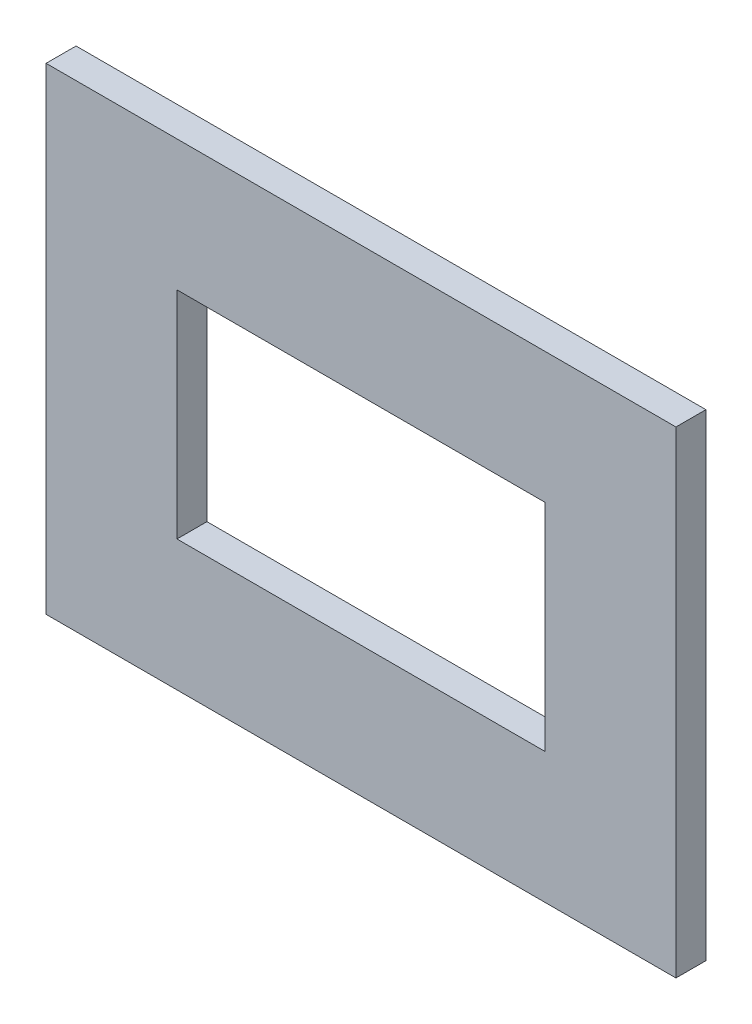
ISO-10303-21;
HEADER;
FILE_DESCRIPTION(('STEP AP214'),'2;1');
FILE_NAME('part.step','',(''),(''),'','','');
FILE_SCHEMA(('AUTOMOTIVE_DESIGN { 1 0 10303 214 1 1 1 1 }'));
ENDSEC;
DATA;
#1=APPLICATION_CONTEXT('core data for automotive mechanical design processes');
#2=APPLICATION_PROTOCOL_DEFINITION('international standard','automotive_design',2000,#1);
#3=PRODUCT_CONTEXT('',#1,'mechanical');
#4=PRODUCT('Part','Part','',(#3));
#5=PRODUCT_RELATED_PRODUCT_CATEGORY('part','',(#4));
#6=PRODUCT_DEFINITION_FORMATION('','',#4);
#7=PRODUCT_DEFINITION_CONTEXT('part definition',#1,'design');
#8=PRODUCT_DEFINITION('design','',#6,#7);
#9=PRODUCT_DEFINITION_SHAPE('','',#8);
#10=(LENGTH_UNIT() NAMED_UNIT(*) SI_UNIT(.MILLI.,.METRE.));
#11=(NAMED_UNIT(*) PLANE_ANGLE_UNIT() SI_UNIT($,.RADIAN.));
#12=(NAMED_UNIT(*) SI_UNIT($,.STERADIAN.) SOLID_ANGLE_UNIT());
#13=UNCERTAINTY_MEASURE_WITH_UNIT(LENGTH_MEASURE(1.E-05),#10,'distance_accuracy_value','');
#14=(GEOMETRIC_REPRESENTATION_CONTEXT(3) GLOBAL_UNCERTAINTY_ASSIGNED_CONTEXT((#13)) GLOBAL_UNIT_ASSIGNED_CONTEXT((#10,
#11,#12)) REPRESENTATION_CONTEXT('',''));
#15=CARTESIAN_POINT('',(0.,0.,0.));
#16=DIRECTION('',(0.,0.,1.));
#17=DIRECTION('',(1.,0.,0.));
#18=AXIS2_PLACEMENT_3D('',#15,#16,#17);
#19=CARTESIAN_POINT('',(0.,0.,15.));
#20=DIRECTION('',(0.,0.,1.));
#21=DIRECTION('',(1.,0.,0.));
#22=AXIS2_PLACEMENT_3D('',#19,#20,#21);
#23=PLANE('',#22);
#24=DIRECTION('',(1.,0.,0.));
#25=VECTOR('',#24,1.);
#26=CARTESIAN_POINT('',(92.075,-53.975,15.));
#27=LINE('',#26,#25);
#28=CARTESIAN_POINT('',(-92.075,-53.975,15.));
#29=VERTEX_POINT('',#28);
#30=CARTESIAN_POINT('',(92.075,-53.975,15.));
#31=VERTEX_POINT('',#30);
#32=EDGE_CURVE('E133',#29,#31,#27,.T.);
#33=ORIENTED_EDGE('',*,*,#32,.F.);
#34=DIRECTION('',(0.,-1.,0.));
#35=VECTOR('',#34,1.);
#36=CARTESIAN_POINT('',(-92.075,-53.975,15.));
#37=LINE('',#36,#35);
#38=CARTESIAN_POINT('',(-92.075,53.975,15.));
#39=VERTEX_POINT('',#38);
#40=EDGE_CURVE('E131',#39,#29,#37,.T.);
#41=ORIENTED_EDGE('',*,*,#40,.F.);
#42=DIRECTION('',(-1.,0.,0.));
#43=VECTOR('',#42,1.);
#44=CARTESIAN_POINT('',(92.075,53.975,15.));
#45=LINE('',#44,#43);
#46=CARTESIAN_POINT('',(92.075,53.975,15.));
#47=VERTEX_POINT('',#46);
#48=EDGE_CURVE('E139',#47,#39,#45,.T.);
#49=ORIENTED_EDGE('',*,*,#48,.F.);
#50=DIRECTION('',(0.,1.,0.));
#51=VECTOR('',#50,1.);
#52=CARTESIAN_POINT('',(92.075,-53.975,15.));
#53=LINE('',#52,#51);
#54=EDGE_CURVE('E136',#31,#47,#53,.T.);
#55=ORIENTED_EDGE('',*,*,#54,.F.);
#56=EDGE_LOOP('',(#33,#41,#49,#55));
#57=FACE_BOUND('',#56,.T.);
#58=DIRECTION('',(-1.,0.,0.));
#59=VECTOR('',#58,1.);
#60=CARTESIAN_POINT('',(-157.561734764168,-119.375719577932,15.));
#61=LINE('',#60,#59);
#62=CARTESIAN_POINT('',(157.561734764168,-119.375719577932,15.));
#63=VERTEX_POINT('',#62);
#64=CARTESIAN_POINT('',(-157.561734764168,-119.375719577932,15.));
#65=VERTEX_POINT('',#64);
#66=EDGE_CURVE('E113',#63,#65,#61,.T.);
#67=ORIENTED_EDGE('',*,*,#66,.F.);
#68=DIRECTION('',(0.,-1.,0.));
#69=VECTOR('',#68,1.);
#70=CARTESIAN_POINT('',(157.561734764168,-119.375719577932,15.));
#71=LINE('',#70,#69);
#72=CARTESIAN_POINT('',(157.561734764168,119.375719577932,15.));
#73=VERTEX_POINT('',#72);
#74=EDGE_CURVE('E47',#73,#63,#71,.T.);
#75=ORIENTED_EDGE('',*,*,#74,.F.);
#76=DIRECTION('',(1.,0.,0.));
#77=VECTOR('',#76,1.);
#78=CARTESIAN_POINT('',(-157.561734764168,119.375719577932,15.));
#79=LINE('',#78,#77);
#80=CARTESIAN_POINT('',(-157.561734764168,119.375719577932,15.));
#81=VERTEX_POINT('',#80);
#82=EDGE_CURVE('E101',#81,#73,#79,.T.);
#83=ORIENTED_EDGE('',*,*,#82,.F.);
#84=DIRECTION('',(0.,1.,0.));
#85=VECTOR('',#84,1.);
#86=CARTESIAN_POINT('',(-157.561734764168,-119.375719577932,15.));
#87=LINE('',#86,#85);
#88=EDGE_CURVE('E108',#65,#81,#87,.T.);
#89=ORIENTED_EDGE('',*,*,#88,.F.);
#90=EDGE_LOOP('',(#67,#75,#83,#89));
#91=FACE_BOUND('',#90,.T.);
#92=ADVANCED_FACE('F32',(#57,#91),#23,.T.);
#93=CARTESIAN_POINT('',(0.,0.,0.));
#94=DIRECTION('',(0.,0.,1.));
#95=DIRECTION('',(1.,0.,0.));
#96=AXIS2_PLACEMENT_3D('',#93,#94,#95);
#97=PLANE('',#96);
#98=DIRECTION('',(0.,-1.,0.));
#99=VECTOR('',#98,1.);
#100=CARTESIAN_POINT('',(-92.075,-53.975,0.));
#101=LINE('',#100,#99);
#102=CARTESIAN_POINT('',(-92.075,53.975,0.));
#103=VERTEX_POINT('',#102);
#104=CARTESIAN_POINT('',(-92.075,-53.975,0.));
#105=VERTEX_POINT('',#104);
#106=EDGE_CURVE('E128',#103,#105,#101,.T.);
#107=ORIENTED_EDGE('',*,*,#106,.T.);
#108=DIRECTION('',(1.,0.,0.));
#109=VECTOR('',#108,1.);
#110=CARTESIAN_POINT('',(92.075,-53.975,0.));
#111=LINE('',#110,#109);
#112=CARTESIAN_POINT('',(92.075,-53.975,0.));
#113=VERTEX_POINT('',#112);
#114=EDGE_CURVE('E144',#105,#113,#111,.T.);
#115=ORIENTED_EDGE('',*,*,#114,.T.);
#116=DIRECTION('',(0.,1.,0.));
#117=VECTOR('',#116,1.);
#118=CARTESIAN_POINT('',(92.075,-53.975,0.));
#119=LINE('',#118,#117);
#120=CARTESIAN_POINT('',(92.075,53.975,0.));
#121=VERTEX_POINT('',#120);
#122=EDGE_CURVE('E147',#113,#121,#119,.T.);
#123=ORIENTED_EDGE('',*,*,#122,.T.);
#124=DIRECTION('',(-1.,0.,0.));
#125=VECTOR('',#124,1.);
#126=CARTESIAN_POINT('',(92.075,53.975,0.));
#127=LINE('',#126,#125);
#128=EDGE_CURVE('E134',#121,#103,#127,.T.);
#129=ORIENTED_EDGE('',*,*,#128,.T.);
#130=EDGE_LOOP('',(#107,#115,#123,#129));
#131=FACE_BOUND('',#130,.T.);
#132=DIRECTION('',(0.,-1.,0.));
#133=VECTOR('',#132,1.);
#134=CARTESIAN_POINT('',(157.561734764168,-119.375719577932,0.));
#135=LINE('',#134,#133);
#136=CARTESIAN_POINT('',(157.561734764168,119.375719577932,0.));
#137=VERTEX_POINT('',#136);
#138=CARTESIAN_POINT('',(157.561734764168,-119.375719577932,0.));
#139=VERTEX_POINT('',#138);
#140=EDGE_CURVE('E120',#137,#139,#135,.T.);
#141=ORIENTED_EDGE('',*,*,#140,.T.);
#142=DIRECTION('',(-1.,0.,0.));
#143=VECTOR('',#142,1.);
#144=CARTESIAN_POINT('',(-157.561734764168,-119.375719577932,0.));
#145=LINE('',#144,#143);
#146=CARTESIAN_POINT('',(-157.561734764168,-119.375719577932,0.));
#147=VERTEX_POINT('',#146);
#148=EDGE_CURVE('E123',#139,#147,#145,.T.);
#149=ORIENTED_EDGE('',*,*,#148,.T.);
#150=DIRECTION('',(0.,1.,0.));
#151=VECTOR('',#150,1.);
#152=CARTESIAN_POINT('',(-157.561734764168,-119.375719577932,0.));
#153=LINE('',#152,#151);
#154=CARTESIAN_POINT('',(-157.561734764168,119.375719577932,0.));
#155=VERTEX_POINT('',#154);
#156=EDGE_CURVE('E55',#147,#155,#153,.T.);
#157=ORIENTED_EDGE('',*,*,#156,.T.);
#158=DIRECTION('',(1.,0.,0.));
#159=VECTOR('',#158,1.);
#160=CARTESIAN_POINT('',(-157.561734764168,119.375719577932,0.));
#161=LINE('',#160,#159);
#162=EDGE_CURVE('E103',#155,#137,#161,.T.);
#163=ORIENTED_EDGE('',*,*,#162,.T.);
#164=EDGE_LOOP('',(#141,#149,#157,#163));
#165=FACE_BOUND('',#164,.T.);
#166=ADVANCED_FACE('F34',(#131,#165),#97,.F.);
#167=CARTESIAN_POINT('',(-92.075,-53.975,15.));
#168=DIRECTION('',(1.,0.,0.));
#169=DIRECTION('',(0.,0.,-1.));
#170=AXIS2_PLACEMENT_3D('',#167,#168,#169);
#171=PLANE('',#170);
#172=ORIENTED_EDGE('',*,*,#106,.F.);
#173=DIRECTION('',(0.,0.,-1.));
#174=VECTOR('',#173,1.);
#175=CARTESIAN_POINT('',(-92.075,53.975,15.));
#176=LINE('',#175,#174);
#177=EDGE_CURVE('E141',#39,#103,#176,.T.);
#178=ORIENTED_EDGE('',*,*,#177,.F.);
#179=ORIENTED_EDGE('',*,*,#40,.T.);
#180=DIRECTION('',(0.,0.,-1.));
#181=VECTOR('',#180,1.);
#182=CARTESIAN_POINT('',(-92.075,-53.975,15.));
#183=LINE('',#182,#181);
#184=EDGE_CURVE('E11',#29,#105,#183,.T.);
#185=ORIENTED_EDGE('',*,*,#184,.T.);
#186=EDGE_LOOP('',(#172,#178,#179,#185));
#187=FACE_BOUND('',#186,.T.);
#188=ADVANCED_FACE('F169',(#187),#171,.T.);
#189=CARTESIAN_POINT('',(92.075,-53.975,15.));
#190=DIRECTION('',(0.,1.,0.));
#191=DIRECTION('',(-1.,0.,0.));
#192=AXIS2_PLACEMENT_3D('',#189,#190,#191);
#193=PLANE('',#192);
#194=ORIENTED_EDGE('',*,*,#114,.F.);
#195=ORIENTED_EDGE('',*,*,#184,.F.);
#196=ORIENTED_EDGE('',*,*,#32,.T.);
#197=DIRECTION('',(0.,0.,-1.));
#198=VECTOR('',#197,1.);
#199=CARTESIAN_POINT('',(92.075,-53.975,15.));
#200=LINE('',#199,#198);
#201=EDGE_CURVE('E40',#31,#113,#200,.T.);
#202=ORIENTED_EDGE('',*,*,#201,.T.);
#203=EDGE_LOOP('',(#194,#195,#196,#202));
#204=FACE_BOUND('',#203,.T.);
#205=ADVANCED_FACE('F158',(#204),#193,.T.);
#206=CARTESIAN_POINT('',(92.075,-53.975,15.));
#207=DIRECTION('',(-1.,0.,0.));
#208=DIRECTION('',(0.,0.,1.));
#209=AXIS2_PLACEMENT_3D('',#206,#207,#208);
#210=PLANE('',#209);
#211=ORIENTED_EDGE('',*,*,#122,.F.);
#212=ORIENTED_EDGE('',*,*,#201,.F.);
#213=ORIENTED_EDGE('',*,*,#54,.T.);
#214=DIRECTION('',(0.,0.,-1.));
#215=VECTOR('',#214,1.);
#216=CARTESIAN_POINT('',(92.075,53.975,15.));
#217=LINE('',#216,#215);
#218=EDGE_CURVE('E154',#47,#121,#217,.T.);
#219=ORIENTED_EDGE('',*,*,#218,.T.);
#220=EDGE_LOOP('',(#211,#212,#213,#219));
#221=FACE_BOUND('',#220,.T.);
#222=ADVANCED_FACE('F163',(#221),#210,.T.);
#223=CARTESIAN_POINT('',(92.075,53.975,15.));
#224=DIRECTION('',(0.,-1.,0.));
#225=DIRECTION('',(1.,0.,0.));
#226=AXIS2_PLACEMENT_3D('',#223,#224,#225);
#227=PLANE('',#226);
#228=ORIENTED_EDGE('',*,*,#128,.F.);
#229=ORIENTED_EDGE('',*,*,#218,.F.);
#230=ORIENTED_EDGE('',*,*,#48,.T.);
#231=ORIENTED_EDGE('',*,*,#177,.T.);
#232=EDGE_LOOP('',(#228,#229,#230,#231));
#233=FACE_BOUND('',#232,.T.);
#234=ADVANCED_FACE('F172',(#233),#227,.T.);
#235=CARTESIAN_POINT('',(157.561734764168,-119.375719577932,15.));
#236=DIRECTION('',(1.,0.,0.));
#237=DIRECTION('',(0.,1.,0.));
#238=AXIS2_PLACEMENT_3D('',#235,#236,#237);
#239=PLANE('',#238);
#240=ORIENTED_EDGE('',*,*,#140,.F.);
#241=DIRECTION('',(0.,0.,-1.));
#242=VECTOR('',#241,1.);
#243=CARTESIAN_POINT('',(157.561734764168,119.375719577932,15.));
#244=LINE('',#243,#242);
#245=EDGE_CURVE('E104',#73,#137,#244,.T.);
#246=ORIENTED_EDGE('',*,*,#245,.F.);
#247=ORIENTED_EDGE('',*,*,#74,.T.);
#248=DIRECTION('',(0.,0.,-1.));
#249=VECTOR('',#248,1.);
#250=CARTESIAN_POINT('',(157.561734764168,-119.375719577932,15.));
#251=LINE('',#250,#249);
#252=EDGE_CURVE('E115',#63,#139,#251,.T.);
#253=ORIENTED_EDGE('',*,*,#252,.T.);
#254=EDGE_LOOP('',(#240,#246,#247,#253));
#255=FACE_BOUND('',#254,.T.);
#256=ADVANCED_FACE('F188',(#255),#239,.T.);
#257=CARTESIAN_POINT('',(-157.561734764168,119.375719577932,15.));
#258=DIRECTION('',(0.,1.,0.));
#259=DIRECTION('',(0.,0.,1.));
#260=AXIS2_PLACEMENT_3D('',#257,#258,#259);
#261=PLANE('',#260);
#262=ORIENTED_EDGE('',*,*,#162,.F.);
#263=DIRECTION('',(0.,0.,-1.));
#264=VECTOR('',#263,1.);
#265=CARTESIAN_POINT('',(-157.561734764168,119.375719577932,15.));
#266=LINE('',#265,#264);
#267=EDGE_CURVE('E97',#81,#155,#266,.T.);
#268=ORIENTED_EDGE('',*,*,#267,.F.);
#269=ORIENTED_EDGE('',*,*,#82,.T.);
#270=ORIENTED_EDGE('',*,*,#245,.T.);
#271=EDGE_LOOP('',(#262,#268,#269,#270));
#272=FACE_BOUND('',#271,.T.);
#273=ADVANCED_FACE('F99',(#272),#261,.T.);
#274=CARTESIAN_POINT('',(-157.561734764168,-119.375719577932,15.));
#275=DIRECTION('',(-1.,0.,0.));
#276=DIRECTION('',(0.,0.,1.));
#277=AXIS2_PLACEMENT_3D('',#274,#275,#276);
#278=PLANE('',#277);
#279=ORIENTED_EDGE('',*,*,#156,.F.);
#280=DIRECTION('',(0.,0.,-1.));
#281=VECTOR('',#280,1.);
#282=CARTESIAN_POINT('',(-157.561734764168,-119.375719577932,15.));
#283=LINE('',#282,#281);
#284=EDGE_CURVE('E105',#65,#147,#283,.T.);
#285=ORIENTED_EDGE('',*,*,#284,.F.);
#286=ORIENTED_EDGE('',*,*,#88,.T.);
#287=ORIENTED_EDGE('',*,*,#267,.T.);
#288=EDGE_LOOP('',(#279,#285,#286,#287));
#289=FACE_BOUND('',#288,.T.);
#290=ADVANCED_FACE('F109',(#289),#278,.T.);
#291=CARTESIAN_POINT('',(-157.561734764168,-119.375719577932,15.));
#292=DIRECTION('',(0.,-1.,0.));
#293=DIRECTION('',(1.,0.,0.));
#294=AXIS2_PLACEMENT_3D('',#291,#292,#293);
#295=PLANE('',#294);
#296=ORIENTED_EDGE('',*,*,#148,.F.);
#297=ORIENTED_EDGE('',*,*,#252,.F.);
#298=ORIENTED_EDGE('',*,*,#66,.T.);
#299=ORIENTED_EDGE('',*,*,#284,.T.);
#300=EDGE_LOOP('',(#296,#297,#298,#299));
#301=FACE_BOUND('',#300,.T.);
#302=ADVANCED_FACE('F191',(#301),#295,.T.);
#303=CLOSED_SHELL('',(#92,#166,#188,#205,#222,#234,#256,#273,#290,#302));
#304=MANIFOLD_SOLID_BREP('B2',#303);
#305=ADVANCED_BREP_SHAPE_REPRESENTATION('',(#18,#304),#14);
#306=SHAPE_DEFINITION_REPRESENTATION(#9,#305);
ENDSEC;
END-ISO-10303-21;
